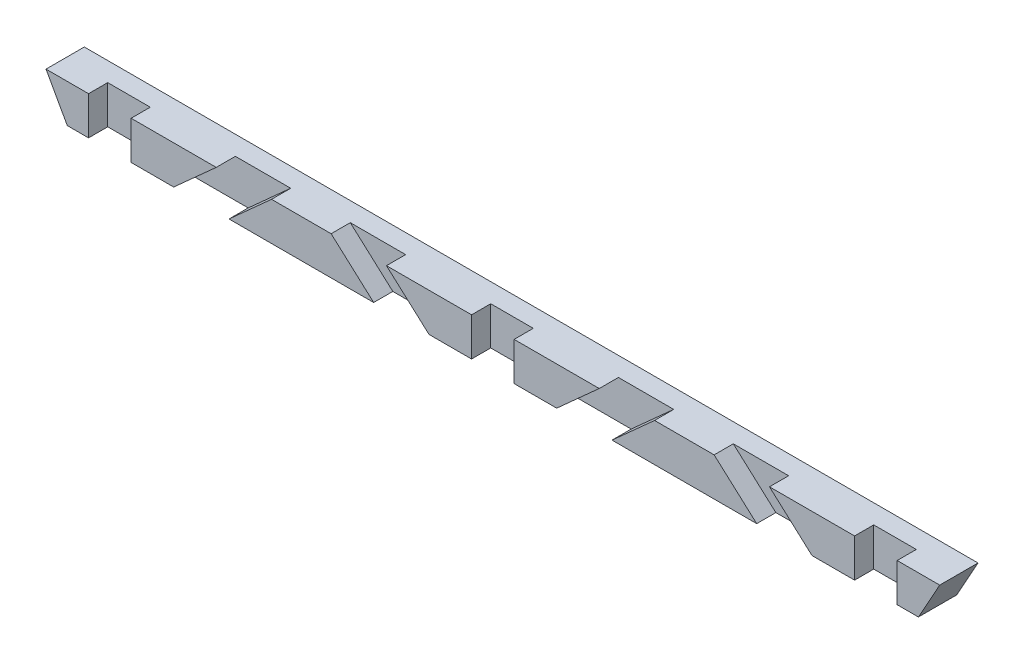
ISO-10303-21;
HEADER;
FILE_DESCRIPTION(('STEP AP214'),'2;1');
FILE_NAME('part.step','',(''),(''),'','','');
FILE_SCHEMA(('AUTOMOTIVE_DESIGN { 1 0 10303 214 1 1 1 1 }'));
ENDSEC;
DATA;
#1=APPLICATION_CONTEXT('core data for automotive mechanical design processes');
#2=APPLICATION_PROTOCOL_DEFINITION('international standard','automotive_design',2000,#1);
#3=PRODUCT_CONTEXT('',#1,'mechanical');
#4=PRODUCT('Part','Part','',(#3));
#5=PRODUCT_RELATED_PRODUCT_CATEGORY('part','',(#4));
#6=PRODUCT_DEFINITION_FORMATION('','',#4);
#7=PRODUCT_DEFINITION_CONTEXT('part definition',#1,'design');
#8=PRODUCT_DEFINITION('design','',#6,#7);
#9=PRODUCT_DEFINITION_SHAPE('','',#8);
#10=(LENGTH_UNIT() NAMED_UNIT(*) SI_UNIT(.MILLI.,.METRE.));
#11=(NAMED_UNIT(*) PLANE_ANGLE_UNIT() SI_UNIT($,.RADIAN.));
#12=(NAMED_UNIT(*) SI_UNIT($,.STERADIAN.) SOLID_ANGLE_UNIT());
#13=UNCERTAINTY_MEASURE_WITH_UNIT(LENGTH_MEASURE(1.E-05),#10,'distance_accuracy_value','');
#14=(GEOMETRIC_REPRESENTATION_CONTEXT(3) GLOBAL_UNCERTAINTY_ASSIGNED_CONTEXT((#13)) GLOBAL_UNIT_ASSIGNED_CONTEXT((#10,
#11,#12)) REPRESENTATION_CONTEXT('',''));
#15=CARTESIAN_POINT('',(0.,0.,0.));
#16=DIRECTION('',(0.,0.,1.));
#17=DIRECTION('',(1.,0.,0.));
#18=AXIS2_PLACEMENT_3D('',#15,#16,#17);
#19=CARTESIAN_POINT('',(0.,9.,9.));
#20=DIRECTION('',(0.,0.,-1.));
#21=DIRECTION('',(-1.,0.,0.));
#22=AXIS2_PLACEMENT_3D('',#19,#20,#21);
#23=PLANE('',#22);
#24=DIRECTION('',(-1.,0.,0.));
#25=VECTOR('',#24,1.);
#26=CARTESIAN_POINT('',(0.,9.,9.));
#27=LINE('',#26,#25);
#28=CARTESIAN_POINT('',(190.,9.,9.));
#29=VERTEX_POINT('',#28);
#30=CARTESIAN_POINT('',(170.,9.,9.));
#31=VERTEX_POINT('',#30);
#32=EDGE_CURVE('E450',#29,#31,#27,.T.);
#33=ORIENTED_EDGE('',*,*,#32,.T.);
#34=DIRECTION('',(-0.743294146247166,0.66896473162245,0.));
#35=VECTOR('',#34,1.);
#36=CARTESIAN_POINT('',(180.,0.,9.));
#37=LINE('',#36,#35);
#38=CARTESIAN_POINT('',(180.,0.,9.));
#39=VERTEX_POINT('',#38);
#40=EDGE_CURVE('E503',#39,#31,#37,.T.);
#41=ORIENTED_EDGE('',*,*,#40,.F.);
#42=DIRECTION('',(1.,0.,0.));
#43=VECTOR('',#42,1.);
#44=CARTESIAN_POINT('',(0.,0.,9.));
#45=LINE('',#44,#43);
#46=CARTESIAN_POINT('',(190.,0.,9.));
#47=VERTEX_POINT('',#46);
#48=EDGE_CURVE('E446',#39,#47,#45,.T.);
#49=ORIENTED_EDGE('',*,*,#48,.T.);
#50=DIRECTION('',(0.,-1.,0.));
#51=VECTOR('',#50,1.);
#52=CARTESIAN_POINT('',(190.,0.,9.));
#53=LINE('',#52,#51);
#54=EDGE_CURVE('E334',#29,#47,#53,.T.);
#55=ORIENTED_EDGE('',*,*,#54,.F.);
#56=EDGE_LOOP('',(#33,#41,#49,#55));
#57=FACE_BOUND('',#56,.T.);
#58=ADVANCED_FACE('F31',(#57),#23,.F.);
#59=CARTESIAN_POINT('',(133.,0.,9.));
#60=VERTEX_POINT('',#59);
#61=CARTESIAN_POINT('',(167.,0.,9.));
#62=VERTEX_POINT('',#61);
#63=EDGE_CURVE('E478',#60,#62,#45,.T.);
#64=ORIENTED_EDGE('',*,*,#63,.T.);
#65=DIRECTION('',(0.743294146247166,-0.66896473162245,0.));
#66=VECTOR('',#65,1.);
#67=CARTESIAN_POINT('',(157.,9.,9.));
#68=LINE('',#67,#66);
#69=CARTESIAN_POINT('',(157.,9.,9.));
#70=VERTEX_POINT('',#69);
#71=EDGE_CURVE('E496',#70,#62,#68,.T.);
#72=ORIENTED_EDGE('',*,*,#71,.F.);
#73=CARTESIAN_POINT('',(143.,9.,9.));
#74=VERTEX_POINT('',#73);
#75=EDGE_CURVE('E260',#70,#74,#27,.T.);
#76=ORIENTED_EDGE('',*,*,#75,.T.);
#77=DIRECTION('',(0.743294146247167,0.668964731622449,0.));
#78=VECTOR('',#77,1.);
#79=CARTESIAN_POINT('',(133.,0.,9.));
#80=LINE('',#79,#78);
#81=EDGE_CURVE('E271',#60,#74,#80,.T.);
#82=ORIENTED_EDGE('',*,*,#81,.F.);
#83=EDGE_LOOP('',(#64,#72,#76,#82));
#84=FACE_BOUND('',#83,.T.);
#85=ADVANCED_FACE('F495',(#84),#23,.F.);
#86=CARTESIAN_POINT('',(43.,0.,9.));
#87=VERTEX_POINT('',#86);
#88=CARTESIAN_POINT('',(77.,0.,9.));
#89=VERTEX_POINT('',#88);
#90=EDGE_CURVE('E477',#87,#89,#45,.T.);
#91=ORIENTED_EDGE('',*,*,#90,.T.);
#92=DIRECTION('',(0.743294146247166,-0.668964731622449,0.));
#93=VECTOR('',#92,1.);
#94=CARTESIAN_POINT('',(77.,0.,9.));
#95=LINE('',#94,#93);
#96=CARTESIAN_POINT('',(67.,9.,9.));
#97=VERTEX_POINT('',#96);
#98=EDGE_CURVE('E284',#97,#89,#95,.T.);
#99=ORIENTED_EDGE('',*,*,#98,.F.);
#100=CARTESIAN_POINT('',(53.,9.,9.));
#101=VERTEX_POINT('',#100);
#102=EDGE_CURVE('E523',#97,#101,#27,.T.);
#103=ORIENTED_EDGE('',*,*,#102,.T.);
#104=DIRECTION('',(0.743294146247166,0.66896473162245,0.));
#105=VECTOR('',#104,1.);
#106=CARTESIAN_POINT('',(53.,9.,9.));
#107=LINE('',#106,#105);
#108=EDGE_CURVE('E320',#87,#101,#107,.T.);
#109=ORIENTED_EDGE('',*,*,#108,.F.);
#110=EDGE_LOOP('',(#91,#99,#103,#109));
#111=FACE_BOUND('',#110,.T.);
#112=ADVANCED_FACE('F558',(#111),#23,.F.);
#113=CARTESIAN_POINT('',(20.,0.,9.));
#114=VERTEX_POINT('',#113);
#115=CARTESIAN_POINT('',(30.,0.,9.));
#116=VERTEX_POINT('',#115);
#117=EDGE_CURVE('E445',#114,#116,#45,.T.);
#118=ORIENTED_EDGE('',*,*,#117,.T.);
#119=DIRECTION('',(-0.743294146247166,-0.66896473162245,0.));
#120=VECTOR('',#119,1.);
#121=CARTESIAN_POINT('',(30.,0.,9.));
#122=LINE('',#121,#120);
#123=CARTESIAN_POINT('',(40.,9.,9.));
#124=VERTEX_POINT('',#123);
#125=EDGE_CURVE('E308',#124,#116,#122,.T.);
#126=ORIENTED_EDGE('',*,*,#125,.F.);
#127=CARTESIAN_POINT('',(20.,9.,9.));
#128=VERTEX_POINT('',#127);
#129=EDGE_CURVE('E520',#124,#128,#27,.T.);
#130=ORIENTED_EDGE('',*,*,#129,.T.);
#131=DIRECTION('',(0.,1.,0.));
#132=VECTOR('',#131,1.);
#133=CARTESIAN_POINT('',(20.,0.,9.));
#134=LINE('',#133,#132);
#135=EDGE_CURVE('E401',#114,#128,#134,.T.);
#136=ORIENTED_EDGE('',*,*,#135,.F.);
#137=EDGE_LOOP('',(#118,#126,#130,#136));
#138=FACE_BOUND('',#137,.T.);
#139=ADVANCED_FACE('F546',(#138),#23,.F.);
#140=CARTESIAN_POINT('',(110.,0.,9.));
#141=VERTEX_POINT('',#140);
#142=CARTESIAN_POINT('',(120.,0.,9.));
#143=VERTEX_POINT('',#142);
#144=EDGE_CURVE('E476',#141,#143,#45,.T.);
#145=ORIENTED_EDGE('',*,*,#144,.T.);
#146=DIRECTION('',(-0.743294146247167,-0.668964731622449,0.));
#147=VECTOR('',#146,1.);
#148=CARTESIAN_POINT('',(130.,9.,9.));
#149=LINE('',#148,#147);
#150=CARTESIAN_POINT('',(130.,9.,9.));
#151=VERTEX_POINT('',#150);
#152=EDGE_CURVE('E278',#151,#143,#149,.T.);
#153=ORIENTED_EDGE('',*,*,#152,.F.);
#154=CARTESIAN_POINT('',(110.,9.,9.));
#155=VERTEX_POINT('',#154);
#156=EDGE_CURVE('E521',#151,#155,#27,.T.);
#157=ORIENTED_EDGE('',*,*,#156,.T.);
#158=DIRECTION('',(0.,1.,0.));
#159=VECTOR('',#158,1.);
#160=CARTESIAN_POINT('',(110.,0.,9.));
#161=LINE('',#160,#159);
#162=EDGE_CURVE('E373',#141,#155,#161,.T.);
#163=ORIENTED_EDGE('',*,*,#162,.F.);
#164=EDGE_LOOP('',(#145,#153,#157,#163));
#165=FACE_BOUND('',#164,.T.);
#166=ADVANCED_FACE('F584',(#165),#23,.F.);
#167=CARTESIAN_POINT('',(100.,9.,9.));
#168=VERTEX_POINT('',#167);
#169=CARTESIAN_POINT('',(80.,9.,9.));
#170=VERTEX_POINT('',#169);
#171=EDGE_CURVE('E519',#168,#170,#27,.T.);
#172=ORIENTED_EDGE('',*,*,#171,.T.);
#173=DIRECTION('',(-0.743294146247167,0.668964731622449,0.));
#174=VECTOR('',#173,1.);
#175=CARTESIAN_POINT('',(80.,9.,9.));
#176=LINE('',#175,#174);
#177=CARTESIAN_POINT('',(90.,0.,9.));
#178=VERTEX_POINT('',#177);
#179=EDGE_CURVE('E295',#178,#170,#176,.T.);
#180=ORIENTED_EDGE('',*,*,#179,.F.);
#181=CARTESIAN_POINT('',(100.,0.,9.));
#182=VERTEX_POINT('',#181);
#183=EDGE_CURVE('E480',#178,#182,#45,.T.);
#184=ORIENTED_EDGE('',*,*,#183,.T.);
#185=DIRECTION('',(0.,-1.,0.));
#186=VECTOR('',#185,1.);
#187=CARTESIAN_POINT('',(100.,0.,9.));
#188=LINE('',#187,#186);
#189=EDGE_CURVE('E361',#168,#182,#188,.T.);
#190=ORIENTED_EDGE('',*,*,#189,.F.);
#191=EDGE_LOOP('',(#172,#180,#184,#190));
#192=FACE_BOUND('',#191,.T.);
#193=ADVANCED_FACE('F569',(#192),#23,.F.);
#194=CARTESIAN_POINT('',(5.,0.,9.));
#195=VERTEX_POINT('',#194);
#196=CARTESIAN_POINT('',(10.,0.,9.));
#197=VERTEX_POINT('',#196);
#198=EDGE_CURVE('E441',#195,#197,#45,.T.);
#199=ORIENTED_EDGE('',*,*,#198,.T.);
#200=DIRECTION('',(0.,-1.,0.));
#201=VECTOR('',#200,1.);
#202=CARTESIAN_POINT('',(10.,0.,9.));
#203=LINE('',#202,#201);
#204=CARTESIAN_POINT('',(10.,9.,9.));
#205=VERTEX_POINT('',#204);
#206=EDGE_CURVE('E389',#205,#197,#203,.T.);
#207=ORIENTED_EDGE('',*,*,#206,.F.);
#208=CARTESIAN_POINT('',(0.,9.,9.));
#209=VERTEX_POINT('',#208);
#210=EDGE_CURVE('E444',#205,#209,#27,.T.);
#211=ORIENTED_EDGE('',*,*,#210,.T.);
#212=DIRECTION('',(-0.485642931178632,0.874157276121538,0.));
#213=VECTOR('',#212,1.);
#214=CARTESIAN_POINT('',(5.,0.,9.));
#215=LINE('',#214,#213);
#216=EDGE_CURVE('E416',#195,#209,#215,.T.);
#217=ORIENTED_EDGE('',*,*,#216,.F.);
#218=EDGE_LOOP('',(#199,#207,#211,#217));
#219=FACE_BOUND('',#218,.T.);
#220=ADVANCED_FACE('F530',(#219),#23,.F.);
#221=CARTESIAN_POINT('',(0.,0.,9.));
#222=DIRECTION('',(0.,1.,0.));
#223=DIRECTION('',(0.,0.,1.));
#224=AXIS2_PLACEMENT_3D('',#221,#222,#223);
#225=PLANE('',#224);
#226=ORIENTED_EDGE('',*,*,#48,.F.);
#227=DIRECTION('',(0.,0.,1.));
#228=VECTOR('',#227,1.);
#229=CARTESIAN_POINT('',(180.,0.,4.5));
#230=LINE('',#229,#228);
#231=CARTESIAN_POINT('',(180.,0.,4.5));
#232=VERTEX_POINT('',#231);
#233=EDGE_CURVE('E263',#232,#39,#230,.T.);
#234=ORIENTED_EDGE('',*,*,#233,.F.);
#235=DIRECTION('',(1.,0.,0.));
#236=VECTOR('',#235,1.);
#237=CARTESIAN_POINT('',(167.,0.,4.5));
#238=LINE('',#237,#236);
#239=CARTESIAN_POINT('',(167.,0.,4.5));
#240=VERTEX_POINT('',#239);
#241=EDGE_CURVE('E249',#240,#232,#238,.T.);
#242=ORIENTED_EDGE('',*,*,#241,.F.);
#243=DIRECTION('',(0.,0.,1.));
#244=VECTOR('',#243,1.);
#245=CARTESIAN_POINT('',(167.,0.,4.5));
#246=LINE('',#245,#244);
#247=EDGE_CURVE('E247',#240,#62,#246,.T.);
#248=ORIENTED_EDGE('',*,*,#247,.T.);
#249=ORIENTED_EDGE('',*,*,#63,.F.);
#250=DIRECTION('',(0.,0.,1.));
#251=VECTOR('',#250,1.);
#252=CARTESIAN_POINT('',(133.,0.,4.5));
#253=LINE('',#252,#251);
#254=CARTESIAN_POINT('',(133.,0.,4.5));
#255=VERTEX_POINT('',#254);
#256=EDGE_CURVE('E285',#255,#60,#253,.T.);
#257=ORIENTED_EDGE('',*,*,#256,.F.);
#258=DIRECTION('',(1.,0.,0.));
#259=VECTOR('',#258,1.);
#260=CARTESIAN_POINT('',(120.,0.,4.5));
#261=LINE('',#260,#259);
#262=CARTESIAN_POINT('',(120.,0.,4.5));
#263=VERTEX_POINT('',#262);
#264=EDGE_CURVE('E274',#263,#255,#261,.T.);
#265=ORIENTED_EDGE('',*,*,#264,.F.);
#266=DIRECTION('',(0.,0.,1.));
#267=VECTOR('',#266,1.);
#268=CARTESIAN_POINT('',(120.,0.,4.5));
#269=LINE('',#268,#267);
#270=EDGE_CURVE('E287',#263,#143,#269,.T.);
#271=ORIENTED_EDGE('',*,*,#270,.T.);
#272=ORIENTED_EDGE('',*,*,#144,.F.);
#273=DIRECTION('',(0.,0.,1.));
#274=VECTOR('',#273,1.);
#275=CARTESIAN_POINT('',(110.,0.,4.5));
#276=LINE('',#275,#274);
#277=CARTESIAN_POINT('',(110.,0.,4.5));
#278=VERTEX_POINT('',#277);
#279=EDGE_CURVE('E393',#278,#141,#276,.T.);
#280=ORIENTED_EDGE('',*,*,#279,.F.);
#281=DIRECTION('',(1.,0.,0.));
#282=VECTOR('',#281,1.);
#283=CARTESIAN_POINT('',(100.,0.,4.5));
#284=LINE('',#283,#282);
#285=CARTESIAN_POINT('',(100.,0.,4.5));
#286=VERTEX_POINT('',#285);
#287=EDGE_CURVE('E372',#286,#278,#284,.T.);
#288=ORIENTED_EDGE('',*,*,#287,.F.);
#289=DIRECTION('',(0.,0.,1.));
#290=VECTOR('',#289,1.);
#291=CARTESIAN_POINT('',(100.,0.,4.5));
#292=LINE('',#291,#290);
#293=EDGE_CURVE('E382',#286,#182,#292,.T.);
#294=ORIENTED_EDGE('',*,*,#293,.T.);
#295=ORIENTED_EDGE('',*,*,#183,.F.);
#296=DIRECTION('',(0.,0.,1.));
#297=VECTOR('',#296,1.);
#298=CARTESIAN_POINT('',(90.,0.,4.5));
#299=LINE('',#298,#297);
#300=CARTESIAN_POINT('',(90.,0.,4.5));
#301=VERTEX_POINT('',#300);
#302=EDGE_CURVE('E312',#301,#178,#299,.T.);
#303=ORIENTED_EDGE('',*,*,#302,.F.);
#304=DIRECTION('',(1.,0.,0.));
#305=VECTOR('',#304,1.);
#306=CARTESIAN_POINT('',(90.,0.,4.5));
#307=LINE('',#306,#305);
#308=CARTESIAN_POINT('',(77.,0.,4.5));
#309=VERTEX_POINT('',#308);
#310=EDGE_CURVE('E294',#309,#301,#307,.T.);
#311=ORIENTED_EDGE('',*,*,#310,.F.);
#312=DIRECTION('',(0.,0.,1.));
#313=VECTOR('',#312,1.);
#314=CARTESIAN_POINT('',(77.,0.,4.5));
#315=LINE('',#314,#313);
#316=EDGE_CURVE('E303',#309,#89,#315,.T.);
#317=ORIENTED_EDGE('',*,*,#316,.T.);
#318=ORIENTED_EDGE('',*,*,#90,.F.);
#319=DIRECTION('',(0.,0.,1.));
#320=VECTOR('',#319,1.);
#321=CARTESIAN_POINT('',(43.,0.,4.5));
#322=LINE('',#321,#320);
#323=CARTESIAN_POINT('',(43.,0.,4.5));
#324=VERTEX_POINT('',#323);
#325=EDGE_CURVE('E338',#324,#87,#322,.T.);
#326=ORIENTED_EDGE('',*,*,#325,.F.);
#327=DIRECTION('',(1.,0.,0.));
#328=VECTOR('',#327,1.);
#329=CARTESIAN_POINT('',(43.,0.,4.5));
#330=LINE('',#329,#328);
#331=CARTESIAN_POINT('',(30.,0.,4.5));
#332=VERTEX_POINT('',#331);
#333=EDGE_CURVE('E319',#332,#324,#330,.T.);
#334=ORIENTED_EDGE('',*,*,#333,.F.);
#335=DIRECTION('',(0.,0.,1.));
#336=VECTOR('',#335,1.);
#337=CARTESIAN_POINT('',(30.,0.,4.5));
#338=LINE('',#337,#336);
#339=EDGE_CURVE('E328',#332,#116,#338,.T.);
#340=ORIENTED_EDGE('',*,*,#339,.T.);
#341=ORIENTED_EDGE('',*,*,#117,.F.);
#342=DIRECTION('',(0.,0.,1.));
#343=VECTOR('',#342,1.);
#344=CARTESIAN_POINT('',(20.,0.,4.5));
#345=LINE('',#344,#343);
#346=CARTESIAN_POINT('',(20.,0.,4.5));
#347=VERTEX_POINT('',#346);
#348=EDGE_CURVE('E420',#347,#114,#345,.T.);
#349=ORIENTED_EDGE('',*,*,#348,.F.);
#350=DIRECTION('',(1.,0.,0.));
#351=VECTOR('',#350,1.);
#352=CARTESIAN_POINT('',(10.,0.,4.5));
#353=LINE('',#352,#351);
#354=CARTESIAN_POINT('',(10.,0.,4.5));
#355=VERTEX_POINT('',#354);
#356=EDGE_CURVE('E400',#355,#347,#353,.T.);
#357=ORIENTED_EDGE('',*,*,#356,.F.);
#358=DIRECTION('',(0.,0.,1.));
#359=VECTOR('',#358,1.);
#360=CARTESIAN_POINT('',(10.,0.,4.5));
#361=LINE('',#360,#359);
#362=EDGE_CURVE('E410',#355,#197,#361,.T.);
#363=ORIENTED_EDGE('',*,*,#362,.T.);
#364=ORIENTED_EDGE('',*,*,#198,.F.);
#365=DIRECTION('',(0.,0.,1.));
#366=VECTOR('',#365,1.);
#367=CARTESIAN_POINT('',(5.,0.,0.));
#368=LINE('',#367,#366);
#369=CARTESIAN_POINT('',(5.,0.,0.));
#370=VERTEX_POINT('',#369);
#371=EDGE_CURVE('E427',#370,#195,#368,.T.);
#372=ORIENTED_EDGE('',*,*,#371,.F.);
#373=DIRECTION('',(1.,0.,0.));
#374=VECTOR('',#373,1.);
#375=CARTESIAN_POINT('',(0.,0.,0.));
#376=LINE('',#375,#374);
#377=CARTESIAN_POINT('',(205.,0.,0.));
#378=VERTEX_POINT('',#377);
#379=EDGE_CURVE('E440',#370,#378,#376,.T.);
#380=ORIENTED_EDGE('',*,*,#379,.T.);
#381=DIRECTION('',(0.,0.,1.));
#382=VECTOR('',#381,1.);
#383=CARTESIAN_POINT('',(205.,0.,0.));
#384=LINE('',#383,#382);
#385=CARTESIAN_POINT('',(205.,0.,9.));
#386=VERTEX_POINT('',#385);
#387=EDGE_CURVE('E435',#378,#386,#384,.T.);
#388=ORIENTED_EDGE('',*,*,#387,.T.);
#389=CARTESIAN_POINT('',(200.,0.,9.));
#390=VERTEX_POINT('',#389);
#391=EDGE_CURVE('E454',#390,#386,#45,.T.);
#392=ORIENTED_EDGE('',*,*,#391,.F.);
#393=DIRECTION('',(0.,0.,1.));
#394=VECTOR('',#393,1.);
#395=CARTESIAN_POINT('',(200.,0.,4.5));
#396=LINE('',#395,#394);
#397=CARTESIAN_POINT('',(200.,0.,4.5));
#398=VERTEX_POINT('',#397);
#399=EDGE_CURVE('E365',#398,#390,#396,.T.);
#400=ORIENTED_EDGE('',*,*,#399,.F.);
#401=DIRECTION('',(1.,0.,0.));
#402=VECTOR('',#401,1.);
#403=CARTESIAN_POINT('',(190.,0.,4.5));
#404=LINE('',#403,#402);
#405=CARTESIAN_POINT('',(190.,0.,4.5));
#406=VERTEX_POINT('',#405);
#407=EDGE_CURVE('E345',#406,#398,#404,.T.);
#408=ORIENTED_EDGE('',*,*,#407,.F.);
#409=DIRECTION('',(0.,0.,1.));
#410=VECTOR('',#409,1.);
#411=CARTESIAN_POINT('',(190.,0.,4.5));
#412=LINE('',#411,#410);
#413=EDGE_CURVE('E355',#406,#47,#412,.T.);
#414=ORIENTED_EDGE('',*,*,#413,.T.);
#415=EDGE_LOOP('',(#226,#234,#242,#248,#249,#257,#265,#271,#272,#280,#288,#294,#295,#303,#311,
#317,#318,#326,#334,#340,#341,#349,#357,#363,#364,#372,#380,#388,#392,#400,#408,#414));
#416=FACE_BOUND('',#415,.T.);
#417=ADVANCED_FACE('F33',(#416),#225,.F.);
#418=CARTESIAN_POINT('',(0.,9.,9.));
#419=DIRECTION('',(0.,-1.,0.));
#420=DIRECTION('',(0.,0.,-1.));
#421=AXIS2_PLACEMENT_3D('',#418,#419,#420);
#422=PLANE('',#421);
#423=DIRECTION('',(-1.,0.,0.));
#424=VECTOR('',#423,1.);
#425=CARTESIAN_POINT('',(170.,9.,4.5));
#426=LINE('',#425,#424);
#427=CARTESIAN_POINT('',(170.,9.00000000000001,4.5));
#428=VERTEX_POINT('',#427);
#429=CARTESIAN_POINT('',(157.,9.,4.5));
#430=VERTEX_POINT('',#429);
#431=EDGE_CURVE('E250',#428,#430,#426,.T.);
#432=ORIENTED_EDGE('',*,*,#431,.F.);
#433=DIRECTION('',(0.,0.,1.));
#434=VECTOR('',#433,1.);
#435=CARTESIAN_POINT('',(170.,9.,4.5));
#436=LINE('',#435,#434);
#437=EDGE_CURVE('E261',#428,#31,#436,.T.);
#438=ORIENTED_EDGE('',*,*,#437,.T.);
#439=ORIENTED_EDGE('',*,*,#32,.F.);
#440=DIRECTION('',(0.,0.,1.));
#441=VECTOR('',#440,1.);
#442=CARTESIAN_POINT('',(190.,9.,4.5));
#443=LINE('',#442,#441);
#444=CARTESIAN_POINT('',(190.,9.,4.5));
#445=VERTEX_POINT('',#444);
#446=EDGE_CURVE('E359',#445,#29,#443,.T.);
#447=ORIENTED_EDGE('',*,*,#446,.F.);
#448=DIRECTION('',(-1.,0.,0.));
#449=VECTOR('',#448,1.);
#450=CARTESIAN_POINT('',(190.,9.,4.5));
#451=LINE('',#450,#449);
#452=CARTESIAN_POINT('',(200.,9.,4.5));
#453=VERTEX_POINT('',#452);
#454=EDGE_CURVE('E352',#453,#445,#451,.T.);
#455=ORIENTED_EDGE('',*,*,#454,.F.);
#456=DIRECTION('',(0.,0.,1.));
#457=VECTOR('',#456,1.);
#458=CARTESIAN_POINT('',(200.,9.,4.5));
#459=LINE('',#458,#457);
#460=CARTESIAN_POINT('',(200.,9.,9.));
#461=VERTEX_POINT('',#460);
#462=EDGE_CURVE('E362',#453,#461,#459,.T.);
#463=ORIENTED_EDGE('',*,*,#462,.T.);
#464=CARTESIAN_POINT('',(210.,9.,9.));
#465=VERTEX_POINT('',#464);
#466=EDGE_CURVE('E447',#465,#461,#27,.T.);
#467=ORIENTED_EDGE('',*,*,#466,.F.);
#468=DIRECTION('',(0.,0.,-1.));
#469=VECTOR('',#468,1.);
#470=CARTESIAN_POINT('',(210.,9.,9.));
#471=LINE('',#470,#469);
#472=CARTESIAN_POINT('',(210.,9.,0.));
#473=VERTEX_POINT('',#472);
#474=EDGE_CURVE('E11',#465,#473,#471,.T.);
#475=ORIENTED_EDGE('',*,*,#474,.T.);
#476=DIRECTION('',(-1.,0.,0.));
#477=VECTOR('',#476,1.);
#478=CARTESIAN_POINT('',(0.,9.,0.));
#479=LINE('',#478,#477);
#480=CARTESIAN_POINT('',(0.,9.,0.));
#481=VERTEX_POINT('',#480);
#482=EDGE_CURVE('E452',#473,#481,#479,.T.);
#483=ORIENTED_EDGE('',*,*,#482,.T.);
#484=DIRECTION('',(0.,0.,-1.));
#485=VECTOR('',#484,1.);
#486=CARTESIAN_POINT('',(0.,9.,9.));
#487=LINE('',#486,#485);
#488=EDGE_CURVE('E39',#209,#481,#487,.T.);
#489=ORIENTED_EDGE('',*,*,#488,.F.);
#490=ORIENTED_EDGE('',*,*,#210,.F.);
#491=DIRECTION('',(0.,0.,1.));
#492=VECTOR('',#491,1.);
#493=CARTESIAN_POINT('',(10.,9.,4.5));
#494=LINE('',#493,#492);
#495=CARTESIAN_POINT('',(10.,9.,4.5));
#496=VERTEX_POINT('',#495);
#497=EDGE_CURVE('E414',#496,#205,#494,.T.);
#498=ORIENTED_EDGE('',*,*,#497,.F.);
#499=DIRECTION('',(-1.,0.,0.));
#500=VECTOR('',#499,1.);
#501=CARTESIAN_POINT('',(10.,9.,4.5));
#502=LINE('',#501,#500);
#503=CARTESIAN_POINT('',(20.,9.,4.5));
#504=VERTEX_POINT('',#503);
#505=EDGE_CURVE('E407',#504,#496,#502,.T.);
#506=ORIENTED_EDGE('',*,*,#505,.F.);
#507=DIRECTION('',(0.,0.,1.));
#508=VECTOR('',#507,1.);
#509=CARTESIAN_POINT('',(20.,9.,4.5));
#510=LINE('',#509,#508);
#511=EDGE_CURVE('E417',#504,#128,#510,.T.);
#512=ORIENTED_EDGE('',*,*,#511,.T.);
#513=ORIENTED_EDGE('',*,*,#129,.F.);
#514=DIRECTION('',(0.,0.,1.));
#515=VECTOR('',#514,1.);
#516=CARTESIAN_POINT('',(40.,9.,4.5));
#517=LINE('',#516,#515);
#518=CARTESIAN_POINT('',(40.,9.,4.5));
#519=VERTEX_POINT('',#518);
#520=EDGE_CURVE('E332',#519,#124,#517,.T.);
#521=ORIENTED_EDGE('',*,*,#520,.F.);
#522=DIRECTION('',(-1.,0.,0.));
#523=VECTOR('',#522,1.);
#524=CARTESIAN_POINT('',(40.,9.,4.5));
#525=LINE('',#524,#523);
#526=CARTESIAN_POINT('',(53.,9.,4.5));
#527=VERTEX_POINT('',#526);
#528=EDGE_CURVE('E325',#527,#519,#525,.T.);
#529=ORIENTED_EDGE('',*,*,#528,.F.);
#530=DIRECTION('',(0.,0.,1.));
#531=VECTOR('',#530,1.);
#532=CARTESIAN_POINT('',(53.,9.,4.5));
#533=LINE('',#532,#531);
#534=EDGE_CURVE('E335',#527,#101,#533,.T.);
#535=ORIENTED_EDGE('',*,*,#534,.T.);
#536=ORIENTED_EDGE('',*,*,#102,.F.);
#537=DIRECTION('',(0.,0.,1.));
#538=VECTOR('',#537,1.);
#539=CARTESIAN_POINT('',(67.,9.,4.5));
#540=LINE('',#539,#538);
#541=CARTESIAN_POINT('',(67.,9.,4.5));
#542=VERTEX_POINT('',#541);
#543=EDGE_CURVE('E306',#542,#97,#540,.T.);
#544=ORIENTED_EDGE('',*,*,#543,.F.);
#545=DIRECTION('',(-1.,0.,0.));
#546=VECTOR('',#545,1.);
#547=CARTESIAN_POINT('',(67.,9.,4.5));
#548=LINE('',#547,#546);
#549=CARTESIAN_POINT('',(80.,9.,4.5));
#550=VERTEX_POINT('',#549);
#551=EDGE_CURVE('E300',#550,#542,#548,.T.);
#552=ORIENTED_EDGE('',*,*,#551,.F.);
#553=DIRECTION('',(0.,0.,1.));
#554=VECTOR('',#553,1.);
#555=CARTESIAN_POINT('',(80.,9.,4.5));
#556=LINE('',#555,#554);
#557=EDGE_CURVE('E309',#550,#170,#556,.T.);
#558=ORIENTED_EDGE('',*,*,#557,.T.);
#559=ORIENTED_EDGE('',*,*,#171,.F.);
#560=DIRECTION('',(0.,0.,1.));
#561=VECTOR('',#560,1.);
#562=CARTESIAN_POINT('',(100.,9.,4.5));
#563=LINE('',#562,#561);
#564=CARTESIAN_POINT('',(100.,9.,4.5));
#565=VERTEX_POINT('',#564);
#566=EDGE_CURVE('E387',#565,#168,#563,.T.);
#567=ORIENTED_EDGE('',*,*,#566,.F.);
#568=DIRECTION('',(-1.,0.,0.));
#569=VECTOR('',#568,1.);
#570=CARTESIAN_POINT('',(100.,9.,4.5));
#571=LINE('',#570,#569);
#572=CARTESIAN_POINT('',(110.,9.,4.5));
#573=VERTEX_POINT('',#572);
#574=EDGE_CURVE('E379',#573,#565,#571,.T.);
#575=ORIENTED_EDGE('',*,*,#574,.F.);
#576=DIRECTION('',(0.,0.,1.));
#577=VECTOR('',#576,1.);
#578=CARTESIAN_POINT('',(110.,9.,4.5));
#579=LINE('',#578,#577);
#580=EDGE_CURVE('E390',#573,#155,#579,.T.);
#581=ORIENTED_EDGE('',*,*,#580,.T.);
#582=ORIENTED_EDGE('',*,*,#156,.F.);
#583=DIRECTION('',(0.,0.,1.));
#584=VECTOR('',#583,1.);
#585=CARTESIAN_POINT('',(130.,9.,4.5));
#586=LINE('',#585,#584);
#587=CARTESIAN_POINT('',(130.,9.,4.5));
#588=VERTEX_POINT('',#587);
#589=EDGE_CURVE('E277',#588,#151,#586,.T.);
#590=ORIENTED_EDGE('',*,*,#589,.F.);
#591=DIRECTION('',(-1.,0.,0.));
#592=VECTOR('',#591,1.);
#593=CARTESIAN_POINT('',(143.,9.,4.5));
#594=LINE('',#593,#592);
#595=CARTESIAN_POINT('',(143.,9.,4.5));
#596=VERTEX_POINT('',#595);
#597=EDGE_CURVE('E268',#596,#588,#594,.T.);
#598=ORIENTED_EDGE('',*,*,#597,.F.);
#599=DIRECTION('',(0.,0.,1.));
#600=VECTOR('',#599,1.);
#601=CARTESIAN_POINT('',(143.,9.,4.5));
#602=LINE('',#601,#600);
#603=EDGE_CURVE('E282',#596,#74,#602,.T.);
#604=ORIENTED_EDGE('',*,*,#603,.T.);
#605=ORIENTED_EDGE('',*,*,#75,.F.);
#606=DIRECTION('',(0.,0.,1.));
#607=VECTOR('',#606,1.);
#608=CARTESIAN_POINT('',(157.,9.,4.5));
#609=LINE('',#608,#607);
#610=EDGE_CURVE('E244',#430,#70,#609,.T.);
#611=ORIENTED_EDGE('',*,*,#610,.F.);
#612=EDGE_LOOP('',(#432,#438,#439,#447,#455,#463,#467,#475,#483,#489,#490,#498,#506,#512,#513,
#521,#529,#535,#536,#544,#552,#558,#559,#567,#575,#581,#582,#590,#598,#604,#605,#611));
#613=FACE_BOUND('',#612,.T.);
#614=ADVANCED_FACE('F258',(#613),#422,.F.);
#615=ORIENTED_EDGE('',*,*,#466,.T.);
#616=DIRECTION('',(0.,1.,0.));
#617=VECTOR('',#616,1.);
#618=CARTESIAN_POINT('',(200.,0.,9.));
#619=LINE('',#618,#617);
#620=EDGE_CURVE('E346',#390,#461,#619,.T.);
#621=ORIENTED_EDGE('',*,*,#620,.F.);
#622=ORIENTED_EDGE('',*,*,#391,.T.);
#623=DIRECTION('',(-0.485642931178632,-0.874157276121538,0.));
#624=VECTOR('',#623,1.);
#625=CARTESIAN_POINT('',(210.,9.,9.));
#626=LINE('',#625,#624);
#627=EDGE_CURVE('E431',#465,#386,#626,.T.);
#628=ORIENTED_EDGE('',*,*,#627,.F.);
#629=EDGE_LOOP('',(#615,#621,#622,#628));
#630=FACE_BOUND('',#629,.T.);
#631=ADVANCED_FACE('F471',(#630),#23,.F.);
#632=CARTESIAN_POINT('',(0.,9.,0.));
#633=DIRECTION('',(0.,0.,-1.));
#634=DIRECTION('',(-1.,0.,0.));
#635=AXIS2_PLACEMENT_3D('',#632,#633,#634);
#636=PLANE('',#635);
#637=DIRECTION('',(-0.485642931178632,0.874157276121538,0.));
#638=VECTOR('',#637,1.);
#639=CARTESIAN_POINT('',(5.,0.,0.));
#640=LINE('',#639,#638);
#641=EDGE_CURVE('E424',#370,#481,#640,.T.);
#642=ORIENTED_EDGE('',*,*,#641,.T.);
#643=ORIENTED_EDGE('',*,*,#482,.F.);
#644=DIRECTION('',(-0.485642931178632,-0.874157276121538,0.));
#645=VECTOR('',#644,1.);
#646=CARTESIAN_POINT('',(210.,9.,0.));
#647=LINE('',#646,#645);
#648=EDGE_CURVE('E432',#473,#378,#647,.T.);
#649=ORIENTED_EDGE('',*,*,#648,.T.);
#650=ORIENTED_EDGE('',*,*,#379,.F.);
#651=EDGE_LOOP('',(#642,#643,#649,#650));
#652=FACE_BOUND('',#651,.T.);
#653=ADVANCED_FACE('F464',(#652),#636,.T.);
#654=CARTESIAN_POINT('',(210.,9.,0.));
#655=DIRECTION('',(-0.874157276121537,0.485642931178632,0.));
#656=DIRECTION('',(-0.485642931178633,-0.874157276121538,0.));
#657=AXIS2_PLACEMENT_3D('',#654,#655,#656);
#658=PLANE('',#657);
#659=ORIENTED_EDGE('',*,*,#627,.T.);
#660=ORIENTED_EDGE('',*,*,#387,.F.);
#661=ORIENTED_EDGE('',*,*,#648,.F.);
#662=ORIENTED_EDGE('',*,*,#474,.F.);
#663=EDGE_LOOP('',(#659,#660,#661,#662));
#664=FACE_BOUND('',#663,.T.);
#665=ADVANCED_FACE('F468',(#664),#658,.F.);
#666=CARTESIAN_POINT('',(5.,0.,0.));
#667=DIRECTION('',(0.874157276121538,0.485642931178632,0.));
#668=DIRECTION('',(-0.485642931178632,0.874157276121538,0.));
#669=AXIS2_PLACEMENT_3D('',#666,#667,#668);
#670=PLANE('',#669);
#671=ORIENTED_EDGE('',*,*,#216,.T.);
#672=ORIENTED_EDGE('',*,*,#488,.T.);
#673=ORIENTED_EDGE('',*,*,#641,.F.);
#674=ORIENTED_EDGE('',*,*,#371,.T.);
#675=EDGE_LOOP('',(#671,#672,#673,#674));
#676=FACE_BOUND('',#675,.T.);
#677=ADVANCED_FACE('F457',(#676),#670,.F.);
#678=CARTESIAN_POINT('',(10.,0.,4.5));
#679=DIRECTION('',(-1.,0.,0.));
#680=DIRECTION('',(0.,0.,1.));
#681=AXIS2_PLACEMENT_3D('',#678,#679,#680);
#682=PLANE('',#681);
#683=ORIENTED_EDGE('',*,*,#206,.T.);
#684=ORIENTED_EDGE('',*,*,#362,.F.);
#685=DIRECTION('',(0.,-1.,0.));
#686=VECTOR('',#685,1.);
#687=CARTESIAN_POINT('',(10.,0.,4.5));
#688=LINE('',#687,#686);
#689=EDGE_CURVE('E397',#496,#355,#688,.T.);
#690=ORIENTED_EDGE('',*,*,#689,.F.);
#691=ORIENTED_EDGE('',*,*,#497,.T.);
#692=EDGE_LOOP('',(#683,#684,#690,#691));
#693=FACE_BOUND('',#692,.T.);
#694=ADVANCED_FACE('F535',(#693),#682,.F.);
#695=CARTESIAN_POINT('',(20.,0.,4.5));
#696=DIRECTION('',(1.,0.,0.));
#697=DIRECTION('',(0.,0.,-1.));
#698=AXIS2_PLACEMENT_3D('',#695,#696,#697);
#699=PLANE('',#698);
#700=ORIENTED_EDGE('',*,*,#135,.T.);
#701=ORIENTED_EDGE('',*,*,#511,.F.);
#702=DIRECTION('',(0.,1.,0.));
#703=VECTOR('',#702,1.);
#704=CARTESIAN_POINT('',(20.,0.,4.5));
#705=LINE('',#704,#703);
#706=EDGE_CURVE('E404',#347,#504,#705,.T.);
#707=ORIENTED_EDGE('',*,*,#706,.F.);
#708=ORIENTED_EDGE('',*,*,#348,.T.);
#709=EDGE_LOOP('',(#700,#701,#707,#708));
#710=FACE_BOUND('',#709,.T.);
#711=ADVANCED_FACE('F541',(#710),#699,.F.);
#712=CARTESIAN_POINT('',(10.,9.,4.5));
#713=DIRECTION('',(0.,0.,-1.));
#714=DIRECTION('',(-1.,0.,0.));
#715=AXIS2_PLACEMENT_3D('',#712,#713,#714);
#716=PLANE('',#715);
#717=ORIENTED_EDGE('',*,*,#689,.T.);
#718=ORIENTED_EDGE('',*,*,#356,.T.);
#719=ORIENTED_EDGE('',*,*,#706,.T.);
#720=ORIENTED_EDGE('',*,*,#505,.T.);
#721=EDGE_LOOP('',(#717,#718,#719,#720));
#722=FACE_BOUND('',#721,.T.);
#723=ADVANCED_FACE('F538',(#722),#716,.F.);
#724=CARTESIAN_POINT('',(100.,0.,4.5));
#725=DIRECTION('',(-1.,0.,0.));
#726=DIRECTION('',(0.,0.,1.));
#727=AXIS2_PLACEMENT_3D('',#724,#725,#726);
#728=PLANE('',#727);
#729=ORIENTED_EDGE('',*,*,#189,.T.);
#730=ORIENTED_EDGE('',*,*,#293,.F.);
#731=DIRECTION('',(0.,-1.,0.));
#732=VECTOR('',#731,1.);
#733=CARTESIAN_POINT('',(100.,0.,4.5));
#734=LINE('',#733,#732);
#735=EDGE_CURVE('E369',#565,#286,#734,.T.);
#736=ORIENTED_EDGE('',*,*,#735,.F.);
#737=ORIENTED_EDGE('',*,*,#566,.T.);
#738=EDGE_LOOP('',(#729,#730,#736,#737));
#739=FACE_BOUND('',#738,.T.);
#740=ADVANCED_FACE('F571',(#739),#728,.F.);
#741=CARTESIAN_POINT('',(110.,0.,4.5));
#742=DIRECTION('',(1.,0.,0.));
#743=DIRECTION('',(0.,0.,-1.));
#744=AXIS2_PLACEMENT_3D('',#741,#742,#743);
#745=PLANE('',#744);
#746=ORIENTED_EDGE('',*,*,#162,.T.);
#747=ORIENTED_EDGE('',*,*,#580,.F.);
#748=DIRECTION('',(0.,1.,0.));
#749=VECTOR('',#748,1.);
#750=CARTESIAN_POINT('',(110.,0.,4.5));
#751=LINE('',#750,#749);
#752=EDGE_CURVE('E376',#278,#573,#751,.T.);
#753=ORIENTED_EDGE('',*,*,#752,.F.);
#754=ORIENTED_EDGE('',*,*,#279,.T.);
#755=EDGE_LOOP('',(#746,#747,#753,#754));
#756=FACE_BOUND('',#755,.T.);
#757=ADVANCED_FACE('F581',(#756),#745,.F.);
#758=CARTESIAN_POINT('',(100.,9.,4.5));
#759=DIRECTION('',(0.,0.,-1.));
#760=DIRECTION('',(-1.,0.,0.));
#761=AXIS2_PLACEMENT_3D('',#758,#759,#760);
#762=PLANE('',#761);
#763=ORIENTED_EDGE('',*,*,#735,.T.);
#764=ORIENTED_EDGE('',*,*,#287,.T.);
#765=ORIENTED_EDGE('',*,*,#752,.T.);
#766=ORIENTED_EDGE('',*,*,#574,.T.);
#767=EDGE_LOOP('',(#763,#764,#765,#766));
#768=FACE_BOUND('',#767,.T.);
#769=ADVANCED_FACE('F576',(#768),#762,.F.);
#770=CARTESIAN_POINT('',(190.,0.,4.5));
#771=DIRECTION('',(-1.,0.,0.));
#772=DIRECTION('',(0.,0.,1.));
#773=AXIS2_PLACEMENT_3D('',#770,#771,#772);
#774=PLANE('',#773);
#775=ORIENTED_EDGE('',*,*,#54,.T.);
#776=ORIENTED_EDGE('',*,*,#413,.F.);
#777=DIRECTION('',(0.,-1.,0.));
#778=VECTOR('',#777,1.);
#779=CARTESIAN_POINT('',(190.,0.,4.5));
#780=LINE('',#779,#778);
#781=EDGE_CURVE('E342',#445,#406,#780,.T.);
#782=ORIENTED_EDGE('',*,*,#781,.F.);
#783=ORIENTED_EDGE('',*,*,#446,.T.);
#784=EDGE_LOOP('',(#775,#776,#782,#783));
#785=FACE_BOUND('',#784,.T.);
#786=ADVANCED_FACE('F514',(#785),#774,.F.);
#787=CARTESIAN_POINT('',(200.,0.,4.5));
#788=DIRECTION('',(1.,0.,0.));
#789=DIRECTION('',(0.,0.,-1.));
#790=AXIS2_PLACEMENT_3D('',#787,#788,#789);
#791=PLANE('',#790);
#792=ORIENTED_EDGE('',*,*,#620,.T.);
#793=ORIENTED_EDGE('',*,*,#462,.F.);
#794=DIRECTION('',(0.,1.,0.));
#795=VECTOR('',#794,1.);
#796=CARTESIAN_POINT('',(200.,0.,4.5));
#797=LINE('',#796,#795);
#798=EDGE_CURVE('E349',#398,#453,#797,.T.);
#799=ORIENTED_EDGE('',*,*,#798,.F.);
#800=ORIENTED_EDGE('',*,*,#399,.T.);
#801=EDGE_LOOP('',(#792,#793,#799,#800));
#802=FACE_BOUND('',#801,.T.);
#803=ADVANCED_FACE('F648',(#802),#791,.F.);
#804=CARTESIAN_POINT('',(190.,9.,4.5));
#805=DIRECTION('',(0.,0.,-1.));
#806=DIRECTION('',(-1.,0.,0.));
#807=AXIS2_PLACEMENT_3D('',#804,#805,#806);
#808=PLANE('',#807);
#809=ORIENTED_EDGE('',*,*,#781,.T.);
#810=ORIENTED_EDGE('',*,*,#407,.T.);
#811=ORIENTED_EDGE('',*,*,#798,.T.);
#812=ORIENTED_EDGE('',*,*,#454,.T.);
#813=EDGE_LOOP('',(#809,#810,#811,#812));
#814=FACE_BOUND('',#813,.T.);
#815=ADVANCED_FACE('F516',(#814),#808,.F.);
#816=CARTESIAN_POINT('',(30.,0.,4.5));
#817=DIRECTION('',(-0.66896473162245,0.743294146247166,0.));
#818=DIRECTION('',(-0.743294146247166,-0.66896473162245,0.));
#819=AXIS2_PLACEMENT_3D('',#816,#817,#818);
#820=PLANE('',#819);
#821=ORIENTED_EDGE('',*,*,#125,.T.);
#822=ORIENTED_EDGE('',*,*,#339,.F.);
#823=DIRECTION('',(-0.743294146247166,-0.66896473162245,0.));
#824=VECTOR('',#823,1.);
#825=CARTESIAN_POINT('',(30.,0.,4.5));
#826=LINE('',#825,#824);
#827=EDGE_CURVE('E316',#519,#332,#826,.T.);
#828=ORIENTED_EDGE('',*,*,#827,.F.);
#829=ORIENTED_EDGE('',*,*,#520,.T.);
#830=EDGE_LOOP('',(#821,#822,#828,#829));
#831=FACE_BOUND('',#830,.T.);
#832=ADVANCED_FACE('F545',(#831),#820,.F.);
#833=CARTESIAN_POINT('',(53.,9.,4.5));
#834=DIRECTION('',(0.66896473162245,-0.743294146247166,0.));
#835=DIRECTION('',(0.743294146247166,0.66896473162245,0.));
#836=AXIS2_PLACEMENT_3D('',#833,#834,#835);
#837=PLANE('',#836);
#838=ORIENTED_EDGE('',*,*,#108,.T.);
#839=ORIENTED_EDGE('',*,*,#534,.F.);
#840=DIRECTION('',(0.743294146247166,0.66896473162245,0.));
#841=VECTOR('',#840,1.);
#842=CARTESIAN_POINT('',(53.,9.,4.5));
#843=LINE('',#842,#841);
#844=EDGE_CURVE('E323',#324,#527,#843,.T.);
#845=ORIENTED_EDGE('',*,*,#844,.F.);
#846=ORIENTED_EDGE('',*,*,#325,.T.);
#847=EDGE_LOOP('',(#838,#839,#845,#846));
#848=FACE_BOUND('',#847,.T.);
#849=ADVANCED_FACE('F554',(#848),#837,.F.);
#850=CARTESIAN_POINT('',(40.,9.,4.5));
#851=DIRECTION('',(0.,0.,-1.));
#852=DIRECTION('',(-1.,0.,0.));
#853=AXIS2_PLACEMENT_3D('',#850,#851,#852);
#854=PLANE('',#853);
#855=ORIENTED_EDGE('',*,*,#827,.T.);
#856=ORIENTED_EDGE('',*,*,#333,.T.);
#857=ORIENTED_EDGE('',*,*,#844,.T.);
#858=ORIENTED_EDGE('',*,*,#528,.T.);
#859=EDGE_LOOP('',(#855,#856,#857,#858));
#860=FACE_BOUND('',#859,.T.);
#861=ADVANCED_FACE('F551',(#860),#854,.F.);
#862=CARTESIAN_POINT('',(77.,0.,4.5));
#863=DIRECTION('',(-0.66896473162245,-0.743294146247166,0.));
#864=DIRECTION('',(0.743294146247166,-0.66896473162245,0.));
#865=AXIS2_PLACEMENT_3D('',#862,#863,#864);
#866=PLANE('',#865);
#867=ORIENTED_EDGE('',*,*,#98,.T.);
#868=ORIENTED_EDGE('',*,*,#316,.F.);
#869=DIRECTION('',(0.743294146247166,-0.668964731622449,0.));
#870=VECTOR('',#869,1.);
#871=CARTESIAN_POINT('',(77.,0.,4.5));
#872=LINE('',#871,#870);
#873=EDGE_CURVE('E291',#542,#309,#872,.T.);
#874=ORIENTED_EDGE('',*,*,#873,.F.);
#875=ORIENTED_EDGE('',*,*,#543,.T.);
#876=EDGE_LOOP('',(#867,#868,#874,#875));
#877=FACE_BOUND('',#876,.T.);
#878=ADVANCED_FACE('F560',(#877),#866,.F.);
#879=CARTESIAN_POINT('',(80.,9.,4.5));
#880=DIRECTION('',(0.668964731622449,0.743294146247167,0.));
#881=DIRECTION('',(-0.743294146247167,0.668964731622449,0.));
#882=AXIS2_PLACEMENT_3D('',#879,#880,#881);
#883=PLANE('',#882);
#884=ORIENTED_EDGE('',*,*,#179,.T.);
#885=ORIENTED_EDGE('',*,*,#557,.F.);
#886=DIRECTION('',(-0.743294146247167,0.668964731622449,0.));
#887=VECTOR('',#886,1.);
#888=CARTESIAN_POINT('',(80.,9.,4.5));
#889=LINE('',#888,#887);
#890=EDGE_CURVE('E298',#301,#550,#889,.T.);
#891=ORIENTED_EDGE('',*,*,#890,.F.);
#892=ORIENTED_EDGE('',*,*,#302,.T.);
#893=EDGE_LOOP('',(#884,#885,#891,#892));
#894=FACE_BOUND('',#893,.T.);
#895=ADVANCED_FACE('F599',(#894),#883,.F.);
#896=CARTESIAN_POINT('',(77.,0.,4.5));
#897=DIRECTION('',(0.,0.,1.));
#898=DIRECTION('',(1.,0.,0.));
#899=AXIS2_PLACEMENT_3D('',#896,#897,#898);
#900=PLANE('',#899);
#901=ORIENTED_EDGE('',*,*,#873,.T.);
#902=ORIENTED_EDGE('',*,*,#310,.T.);
#903=ORIENTED_EDGE('',*,*,#890,.T.);
#904=ORIENTED_EDGE('',*,*,#551,.T.);
#905=EDGE_LOOP('',(#901,#902,#903,#904));
#906=FACE_BOUND('',#905,.T.);
#907=ADVANCED_FACE('F564',(#906),#900,.T.);
#908=CARTESIAN_POINT('',(133.,0.,4.5));
#909=DIRECTION('',(0.668964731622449,-0.743294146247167,0.));
#910=DIRECTION('',(0.743294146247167,0.668964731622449,0.));
#911=AXIS2_PLACEMENT_3D('',#908,#909,#910);
#912=PLANE('',#911);
#913=ORIENTED_EDGE('',*,*,#81,.T.);
#914=ORIENTED_EDGE('',*,*,#603,.F.);
#915=DIRECTION('',(0.743294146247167,0.668964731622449,0.));
#916=VECTOR('',#915,1.);
#917=CARTESIAN_POINT('',(133.,0.,4.5));
#918=LINE('',#917,#916);
#919=EDGE_CURVE('E54',#255,#596,#918,.T.);
#920=ORIENTED_EDGE('',*,*,#919,.F.);
#921=ORIENTED_EDGE('',*,*,#256,.T.);
#922=EDGE_LOOP('',(#913,#914,#920,#921));
#923=FACE_BOUND('',#922,.T.);
#924=ADVANCED_FACE('F591',(#923),#912,.F.);
#925=CARTESIAN_POINT('',(130.,9.,4.5));
#926=DIRECTION('',(-0.668964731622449,0.743294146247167,0.));
#927=DIRECTION('',(-0.743294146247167,-0.668964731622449,0.));
#928=AXIS2_PLACEMENT_3D('',#925,#926,#927);
#929=PLANE('',#928);
#930=ORIENTED_EDGE('',*,*,#152,.T.);
#931=ORIENTED_EDGE('',*,*,#270,.F.);
#932=DIRECTION('',(-0.743294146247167,-0.668964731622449,0.));
#933=VECTOR('',#932,1.);
#934=CARTESIAN_POINT('',(130.,9.,4.5));
#935=LINE('',#934,#933);
#936=EDGE_CURVE('E270',#588,#263,#935,.T.);
#937=ORIENTED_EDGE('',*,*,#936,.F.);
#938=ORIENTED_EDGE('',*,*,#589,.T.);
#939=EDGE_LOOP('',(#930,#931,#937,#938));
#940=FACE_BOUND('',#939,.T.);
#941=ADVANCED_FACE('F587',(#940),#929,.F.);
#942=CARTESIAN_POINT('',(130.,9.,4.5));
#943=DIRECTION('',(0.,0.,1.));
#944=DIRECTION('',(1.,0.,0.));
#945=AXIS2_PLACEMENT_3D('',#942,#943,#944);
#946=PLANE('',#945);
#947=ORIENTED_EDGE('',*,*,#597,.T.);
#948=ORIENTED_EDGE('',*,*,#936,.T.);
#949=ORIENTED_EDGE('',*,*,#264,.T.);
#950=ORIENTED_EDGE('',*,*,#919,.T.);
#951=EDGE_LOOP('',(#947,#948,#949,#950));
#952=FACE_BOUND('',#951,.T.);
#953=ADVANCED_FACE('F588',(#952),#946,.T.);
#954=CARTESIAN_POINT('',(180.,0.,4.5));
#955=DIRECTION('',(0.66896473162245,0.743294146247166,0.));
#956=DIRECTION('',(-0.743294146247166,0.66896473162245,0.));
#957=AXIS2_PLACEMENT_3D('',#954,#955,#956);
#958=PLANE('',#957);
#959=ORIENTED_EDGE('',*,*,#40,.T.);
#960=ORIENTED_EDGE('',*,*,#437,.F.);
#961=DIRECTION('',(-0.743294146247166,0.66896473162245,0.));
#962=VECTOR('',#961,1.);
#963=CARTESIAN_POINT('',(180.,0.,4.5));
#964=LINE('',#963,#962);
#965=EDGE_CURVE('E46',#232,#428,#964,.T.);
#966=ORIENTED_EDGE('',*,*,#965,.F.);
#967=ORIENTED_EDGE('',*,*,#233,.T.);
#968=EDGE_LOOP('',(#959,#960,#966,#967));
#969=FACE_BOUND('',#968,.T.);
#970=ADVANCED_FACE('F507',(#969),#958,.F.);
#971=CARTESIAN_POINT('',(157.,9.,4.5));
#972=DIRECTION('',(-0.66896473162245,-0.743294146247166,0.));
#973=DIRECTION('',(0.743294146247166,-0.66896473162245,0.));
#974=AXIS2_PLACEMENT_3D('',#971,#972,#973);
#975=PLANE('',#974);
#976=ORIENTED_EDGE('',*,*,#71,.T.);
#977=ORIENTED_EDGE('',*,*,#247,.F.);
#978=DIRECTION('',(0.743294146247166,-0.66896473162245,0.));
#979=VECTOR('',#978,1.);
#980=CARTESIAN_POINT('',(157.,9.,4.5));
#981=LINE('',#980,#979);
#982=EDGE_CURVE('E241',#430,#240,#981,.T.);
#983=ORIENTED_EDGE('',*,*,#982,.F.);
#984=ORIENTED_EDGE('',*,*,#610,.T.);
#985=EDGE_LOOP('',(#976,#977,#983,#984));
#986=FACE_BOUND('',#985,.T.);
#987=ADVANCED_FACE('F242',(#986),#975,.F.);
#988=CARTESIAN_POINT('',(170.,9.,4.5));
#989=DIRECTION('',(0.,0.,1.));
#990=DIRECTION('',(1.,0.,0.));
#991=AXIS2_PLACEMENT_3D('',#988,#989,#990);
#992=PLANE('',#991);
#993=ORIENTED_EDGE('',*,*,#965,.T.);
#994=ORIENTED_EDGE('',*,*,#431,.T.);
#995=ORIENTED_EDGE('',*,*,#982,.T.);
#996=ORIENTED_EDGE('',*,*,#241,.T.);
#997=EDGE_LOOP('',(#993,#994,#995,#996));
#998=FACE_BOUND('',#997,.T.);
#999=ADVANCED_FACE('F253',(#998),#992,.T.);
#1000=CLOSED_SHELL('',(#58,#85,#112,#139,#166,#193,#220,#417,#614,#631,#653,#665,#677,#694,#711,
#723,#740,#757,#769,#786,#803,#815,#832,#849,#861,#878,#895,#907,#924,#941,#953,#970,#987,#999));
#1001=MANIFOLD_SOLID_BREP('B2',#1000);
#1002=ADVANCED_BREP_SHAPE_REPRESENTATION('',(#18,#1001),#14);
#1003=SHAPE_DEFINITION_REPRESENTATION(#9,#1002);
ENDSEC;
END-ISO-10303-21;
